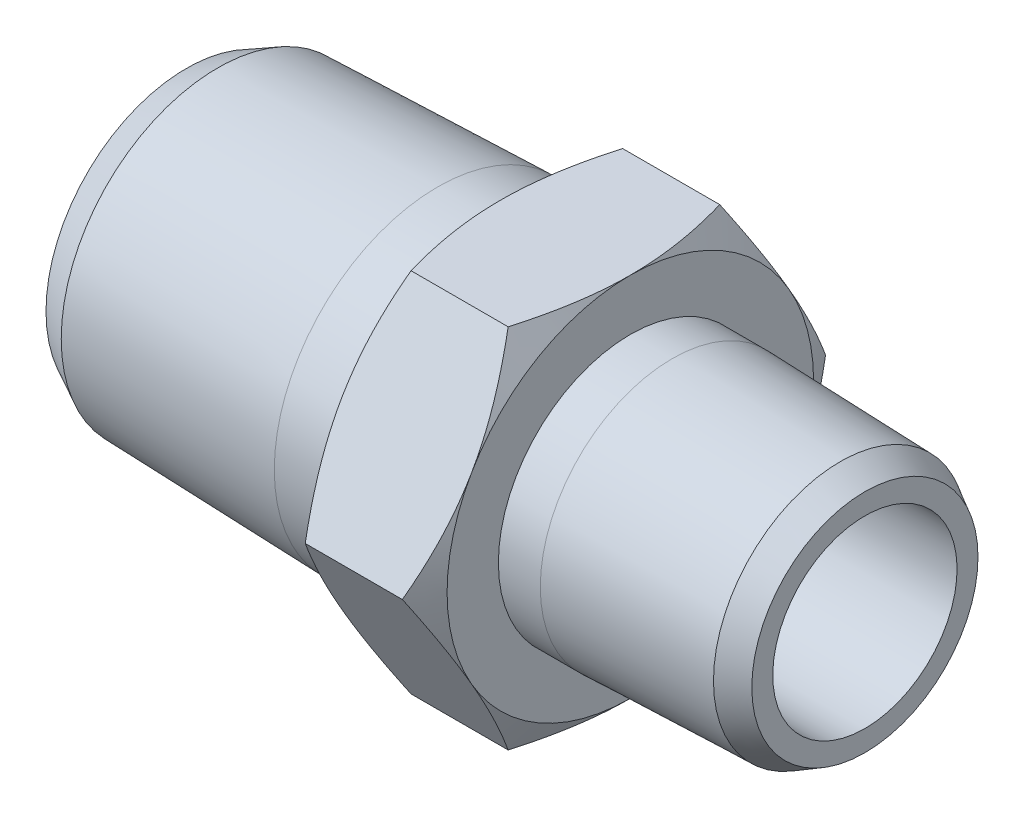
ISO-10303-21;
HEADER;
FILE_DESCRIPTION(('STEP AP214'),'2;1');
FILE_NAME('part.step','',(''),(''),'','','');
FILE_SCHEMA(('AUTOMOTIVE_DESIGN { 1 0 10303 214 1 1 1 1 }'));
ENDSEC;
DATA;
#1=APPLICATION_CONTEXT('core data for automotive mechanical design processes');
#2=APPLICATION_PROTOCOL_DEFINITION('international standard','automotive_design',2000,#1);
#3=PRODUCT_CONTEXT('',#1,'mechanical');
#4=PRODUCT('Part','Part','',(#3));
#5=PRODUCT_RELATED_PRODUCT_CATEGORY('part','',(#4));
#6=PRODUCT_DEFINITION_FORMATION('','',#4);
#7=PRODUCT_DEFINITION_CONTEXT('part definition',#1,'design');
#8=PRODUCT_DEFINITION('design','',#6,#7);
#9=PRODUCT_DEFINITION_SHAPE('','',#8);
#10=(LENGTH_UNIT() NAMED_UNIT(*) SI_UNIT(.MILLI.,.METRE.));
#11=(NAMED_UNIT(*) PLANE_ANGLE_UNIT() SI_UNIT($,.RADIAN.));
#12=(NAMED_UNIT(*) SI_UNIT($,.STERADIAN.) SOLID_ANGLE_UNIT());
#13=UNCERTAINTY_MEASURE_WITH_UNIT(LENGTH_MEASURE(1.E-05),#10,'distance_accuracy_value','');
#14=(GEOMETRIC_REPRESENTATION_CONTEXT(3) GLOBAL_UNCERTAINTY_ASSIGNED_CONTEXT((#13)) GLOBAL_UNIT_ASSIGNED_CONTEXT((#10,
#11,#12)) REPRESENTATION_CONTEXT('',''));
#15=CARTESIAN_POINT('',(0.,0.,0.));
#16=DIRECTION('',(0.,0.,1.));
#17=DIRECTION('',(1.,0.,0.));
#18=AXIS2_PLACEMENT_3D('',#15,#16,#17);
#19=CARTESIAN_POINT('',(6.87551636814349,0.,0.));
#20=DIRECTION('',(-1.,0.,0.));
#21=DIRECTION('',(0.,0.,1.));
#22=AXIS2_PLACEMENT_3D('',#19,#20,#21);
#23=CONICAL_SURFACE('',#22,12.8419243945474,1.04719755);
#24=CARTESIAN_POINT('',(7.87400000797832,0.,0.));
#25=DIRECTION('',(-1.,0.,0.));
#26=DIRECTION('',(0.,0.,1.));
#27=AXIS2_PLACEMENT_3D('',#24,#25,#26);
#28=CIRCLE('',#27,11.1125000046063);
#29=CARTESIAN_POINT('',(7.87400000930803,-5.55625000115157,-9.62370730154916));
#30=VERTEX_POINT('',#29);
#31=CARTESIAN_POINT('',(7.87400000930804,5.55625000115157,-9.62370730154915));
#32=VERTEX_POINT('',#31);
#33=EDGE_CURVE('E109',#30,#32,#28,.F.);
#34=ORIENTED_EDGE('',*,*,#33,.F.);
#35=CARTESIAN_POINT('',(6.88147153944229,2.33098820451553E-09,-12.8316097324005));
#36=CARTESIAN_POINT('',(7.03228295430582,-0.452484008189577,-12.5703679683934));
#37=CARTESIAN_POINT('',(7.17043497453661,-0.908289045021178,-12.307208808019));
#38=CARTESIAN_POINT('',(7.35330997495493,-1.59559748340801,-11.9103910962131));
#39=CARTESIAN_POINT('',(7.4100993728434,-1.82473208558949,-11.7781001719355));
#40=CARTESIAN_POINT('',(7.51490298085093,-2.28450342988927,-11.5126510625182));
#41=CARTESIAN_POINT('',(7.56291772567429,-2.51514007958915,-11.3794929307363));
#42=CARTESIAN_POINT('',(7.64940689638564,-2.97804210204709,-11.1122363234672));
#43=CARTESIAN_POINT('',(7.6878697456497,-3.2103091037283,-10.9781369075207));
#44=CARTESIAN_POINT('',(7.75444708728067,-3.67595402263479,-10.7092966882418));
#45=CARTESIAN_POINT('',(7.78256185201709,-3.9093319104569,-10.5745559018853));
#46=CARTESIAN_POINT('',(7.82795324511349,-4.37806313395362,-10.3039338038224));
#47=CARTESIAN_POINT('',(7.84517475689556,-4.6134205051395,-10.1680501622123));
#48=CARTESIAN_POINT('',(7.86822211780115,-5.08459811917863,-9.89601563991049));
#49=CARTESIAN_POINT('',(7.8740457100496,-5.32041844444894,-9.75986471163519));
#50=CARTESIAN_POINT('',(7.87400001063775,-5.55624999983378,-9.62370729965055));
#51=B_SPLINE_CURVE_WITH_KNOTS('',3,(#35,#36,#37,#38,#39,#40,#41,#42,#43,#44,#45,#46,#47,#48,#49,
#50),.UNSPECIFIED.,.F.,.F.,(4,2,2,2,2,2,2,4),(0.,1.63139647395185,2.44310868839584,
3.25477142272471,4.06741312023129,4.88003342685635,5.69673313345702,6.51359453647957),.UNSPECIFIED.);
#52=CARTESIAN_POINT('',(6.88147154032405,0.,-12.8316097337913));
#53=VERTEX_POINT('',#52);
#54=EDGE_CURVE('E122',#53,#30,#51,.T.);
#55=ORIENTED_EDGE('',*,*,#54,.F.);
#56=CARTESIAN_POINT('',(7.8740000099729,5.55624999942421,-9.62370729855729));
#57=CARTESIAN_POINT('',(7.87404570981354,5.32041844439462,-9.75986471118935));
#58=CARTESIAN_POINT('',(7.86822211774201,5.08459811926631,-9.89601563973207));
#59=CARTESIAN_POINT('',(7.84517475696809,4.61342050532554,-10.1680501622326));
#60=CARTESIAN_POINT('',(7.82795324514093,4.37806313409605,-10.3039338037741));
#61=CARTESIAN_POINT('',(7.78256185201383,3.90933191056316,-10.5745559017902));
#62=CARTESIAN_POINT('',(7.75444708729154,3.67595402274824,-10.7092966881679));
#63=CARTESIAN_POINT('',(7.68786974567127,3.2103091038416,-10.9781369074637));
#64=CARTESIAN_POINT('',(7.64940689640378,2.97804210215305,-11.1122363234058));
#65=CARTESIAN_POINT('',(7.56291772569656,2.51514007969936,-11.3794929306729));
#66=CARTESIAN_POINT('',(7.51490298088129,2.284503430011,-11.5126510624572));
#67=CARTESIAN_POINT('',(7.41009937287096,1.82473208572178,-11.7781001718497));
#68=CARTESIAN_POINT('',(7.35330997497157,1.59559748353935,-11.9103910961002));
#69=CARTESIAN_POINT('',(7.17043497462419,0.908289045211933,-12.3072088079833));
#70=CARTESIAN_POINT('',(7.03228295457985,0.452484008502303,-12.5703679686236));
#71=CARTESIAN_POINT('',(6.88147154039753,-1.60148470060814E-09,-12.831609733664));
#72=B_SPLINE_CURVE_WITH_KNOTS('',3,(#56,#57,#58,#59,#60,#61,#62,#63,#64,#65,#66,#67,#68,#69,#70,
#71),.UNSPECIFIED.,.F.,.F.,(4,2,2,2,2,2,2,4),(0.,0.816861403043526,1.63356110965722,
2.44618141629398,3.25882311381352,4.07048584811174,4.88219806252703,6.51359453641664),.UNSPECIFIED.);
#73=EDGE_CURVE('E131',#32,#53,#72,.T.);
#74=ORIENTED_EDGE('',*,*,#73,.F.);
#75=EDGE_LOOP('',(#34,#55,#74));
#76=FACE_BOUND('',#75,.T.);
#77=ADVANCED_FACE('F16',(#76),#23,.T.);
#78=CARTESIAN_POINT('',(6.87551636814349,0.,0.));
#79=DIRECTION('',(-1.,0.,0.));
#80=DIRECTION('',(0.,0.,1.));
#81=AXIS2_PLACEMENT_3D('',#78,#79,#80);
#82=CONICAL_SURFACE('',#81,12.8419243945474,1.04719755);
#83=CARTESIAN_POINT('',(7.87400000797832,0.,0.));
#84=DIRECTION('',(-1.,0.,0.));
#85=DIRECTION('',(0.,0.,1.));
#86=AXIS2_PLACEMENT_3D('',#83,#84,#85);
#87=CIRCLE('',#86,11.1125000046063);
#88=CARTESIAN_POINT('',(7.87400000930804,11.1125000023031,0.));
#89=VERTEX_POINT('',#88);
#90=EDGE_CURVE('E133',#32,#89,#87,.F.);
#91=ORIENTED_EDGE('',*,*,#90,.F.);
#92=CARTESIAN_POINT('',(6.88147153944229,11.1125000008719,-6.41580486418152));
#93=CARTESIAN_POINT('',(7.03228295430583,10.660015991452,-6.67704663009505));
#94=CARTESIAN_POINT('',(7.17043497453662,10.2042109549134,-6.94020579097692));
#95=CARTESIAN_POINT('',(7.35330997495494,9.51690251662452,-7.3370235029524));
#96=CARTESIAN_POINT('',(7.41009937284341,9.28776791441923,-7.46931442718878));
#97=CARTESIAN_POINT('',(7.51490298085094,8.82799657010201,-7.73476353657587));
#98=CARTESIAN_POINT('',(7.5629177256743,8.59735992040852,-7.86792166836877));
#99=CARTESIAN_POINT('',(7.64940689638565,8.13445789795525,-8.13517827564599));
#100=CARTESIAN_POINT('',(7.68786974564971,7.90219089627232,-8.26927769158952));
#101=CARTESIAN_POINT('',(7.75444708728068,7.43654597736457,-8.53811791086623));
#102=CARTESIAN_POINT('',(7.7825618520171,7.20316808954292,-8.67285869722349));
#103=CARTESIAN_POINT('',(7.82795324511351,6.73443686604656,-8.94348079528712));
#104=CARTESIAN_POINT('',(7.84517475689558,6.49907949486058,-9.079364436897));
#105=CARTESIAN_POINT('',(7.86822211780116,6.02790188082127,-9.35139895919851));
#106=CARTESIAN_POINT('',(7.87404571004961,5.79208155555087,-9.48754988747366));
#107=CARTESIAN_POINT('',(7.87400001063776,5.55625000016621,-9.62370729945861));
#108=B_SPLINE_CURVE_WITH_KNOTS('',3,(#92,#93,#94,#95,#96,#97,#98,#99,#100,#101,#102,#103,#104,
#105,#106,#107),.UNSPECIFIED.,.F.,.F.,(4,2,2,2,2,2,2,4),(0.,1.63139647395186,2.44310868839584,
3.25477142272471,4.0674131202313,4.88003342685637,5.69673313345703,6.51359453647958),.UNSPECIFIED.);
#109=CARTESIAN_POINT('',(6.88147154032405,11.112500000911,-6.41580486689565));
#110=VERTEX_POINT('',#109);
#111=EDGE_CURVE('E121',#110,#32,#108,.T.);
#112=ORIENTED_EDGE('',*,*,#111,.F.);
#113=CARTESIAN_POINT('',(7.8740000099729,11.1124999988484,0.));
#114=CARTESIAN_POINT('',(7.87404570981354,11.1124999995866,-0.272314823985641));
#115=CARTESIAN_POINT('',(7.868222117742,11.1124999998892,-0.544616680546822));
#116=CARTESIAN_POINT('',(7.84517475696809,11.1125000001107,-1.08868572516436));
#117=CARTESIAN_POINT('',(7.82795324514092,11.1125000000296,-1.36045300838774));
#118=CARTESIAN_POINT('',(7.78256185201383,11.1124999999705,-1.90169720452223));
#119=CARTESIAN_POINT('',(7.75444708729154,11.1124999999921,-2.17117877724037));
#120=CARTESIAN_POINT('',(7.68786974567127,11.1125000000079,-2.70885921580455));
#121=CARTESIAN_POINT('',(7.64940689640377,11.1125000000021,-2.97705804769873));
#122=CARTESIAN_POINT('',(7.56291772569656,11.1124999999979,-3.51157126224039));
#123=CARTESIAN_POINT('',(7.51490298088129,11.1124999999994,-3.77788752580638));
#124=CARTESIAN_POINT('',(7.41009937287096,11.1125000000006,-4.30878574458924));
#125=CARTESIAN_POINT('',(7.35330997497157,11.1125000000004,-4.57336759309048));
#126=CARTESIAN_POINT('',(7.17043497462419,11.1124999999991,-5.36700301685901));
#127=CARTESIAN_POINT('',(7.03228295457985,11.1124999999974,-5.89332133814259));
#128=CARTESIAN_POINT('',(6.88147154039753,11.1125,-6.41580486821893));
#129=B_SPLINE_CURVE_WITH_KNOTS('',3,(#113,#114,#115,#116,#117,#118,#119,#120,#121,#122,#123,
#124,#125,#126,#127,#128),.UNSPECIFIED.,.F.,.F.,(4,2,2,2,2,2,2,4),(0.,0.816861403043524,
1.63356110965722,2.44618141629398,3.25882311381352,4.07048584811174,4.88219806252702,
6.51359453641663),.UNSPECIFIED.);
#130=EDGE_CURVE('E424',#89,#110,#129,.T.);
#131=ORIENTED_EDGE('',*,*,#130,.F.);
#132=EDGE_LOOP('',(#91,#112,#131));
#133=FACE_BOUND('',#132,.T.);
#134=ADVANCED_FACE('F157',(#133),#82,.T.);
#135=CARTESIAN_POINT('',(6.87551636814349,0.,0.));
#136=DIRECTION('',(-1.,0.,0.));
#137=DIRECTION('',(0.,0.,1.));
#138=AXIS2_PLACEMENT_3D('',#135,#136,#137);
#139=CONICAL_SURFACE('',#138,12.8419243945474,1.04719755);
#140=CARTESIAN_POINT('',(7.8740000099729,5.55624999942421,9.62370729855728));
#141=CARTESIAN_POINT('',(7.87404570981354,5.79208155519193,9.4875498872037));
#142=CARTESIAN_POINT('',(7.86822211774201,6.02790188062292,9.35139895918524));
#143=CARTESIAN_POINT('',(7.84517475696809,6.49907949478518,9.07936443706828));
#144=CARTESIAN_POINT('',(7.82795324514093,6.73443686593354,8.94348079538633));
#145=CARTESIAN_POINT('',(7.78256185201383,7.20316808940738,8.67285869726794));
#146=CARTESIAN_POINT('',(7.75444708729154,7.43654597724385,8.53811791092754));
#147=CARTESIAN_POINT('',(7.68786974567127,7.90219089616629,8.26927769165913));
#148=CARTESIAN_POINT('',(7.64940689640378,8.13445789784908,8.13517827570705));
#149=CARTESIAN_POINT('',(7.56291772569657,8.5973599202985,7.86792166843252));
#150=CARTESIAN_POINT('',(7.5149029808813,8.82799656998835,7.73476353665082));
#151=CARTESIAN_POINT('',(7.41009937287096,9.28776791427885,7.4693144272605));
#152=CARTESIAN_POINT('',(7.35330997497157,9.51690251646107,7.33702350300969));
#153=CARTESIAN_POINT('',(7.1704349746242,10.2042109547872,6.94020579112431));
#154=CARTESIAN_POINT('',(7.03228295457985,10.6600159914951,6.67704663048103));
#155=CARTESIAN_POINT('',(6.88147154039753,11.1125000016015,6.4158048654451));
#156=B_SPLINE_CURVE_WITH_KNOTS('',3,(#140,#141,#142,#143,#144,#145,#146,#147,#148,#149,#150,
#151,#152,#153,#154,#155),.UNSPECIFIED.,.F.,.F.,(4,2,2,2,2,2,2,4),(0.,0.816861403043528,
1.63356110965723,2.44618141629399,3.25882311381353,4.07048584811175,4.88219806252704,
6.51359453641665),.UNSPECIFIED.);
#157=CARTESIAN_POINT('',(7.87400000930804,5.55625000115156,9.62370730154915));
#158=VERTEX_POINT('',#157);
#159=CARTESIAN_POINT('',(6.88147154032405,11.112500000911,6.41580486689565));
#160=VERTEX_POINT('',#159);
#161=EDGE_CURVE('E421',#158,#160,#156,.T.);
#162=ORIENTED_EDGE('',*,*,#161,.F.);
#163=CARTESIAN_POINT('',(7.87400000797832,0.,0.));
#164=DIRECTION('',(-1.,0.,0.));
#165=DIRECTION('',(0.,0.,1.));
#166=AXIS2_PLACEMENT_3D('',#163,#164,#165);
#167=CIRCLE('',#166,11.1125000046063);
#168=EDGE_CURVE('E134',#89,#158,#167,.F.);
#169=ORIENTED_EDGE('',*,*,#168,.F.);
#170=CARTESIAN_POINT('',(6.8814715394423,11.1124999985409,6.41580486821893));
#171=CARTESIAN_POINT('',(7.03228295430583,11.1124999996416,5.89332133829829));
#172=CARTESIAN_POINT('',(7.17043497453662,11.1124999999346,5.36700301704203));
#173=CARTESIAN_POINT('',(7.35330997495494,11.1125000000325,4.57336759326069));
#174=CARTESIAN_POINT('',(7.41009937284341,11.1125000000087,4.30878574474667));
#175=CARTESIAN_POINT('',(7.51490298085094,11.1124999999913,3.77788752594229));
#176=CARTESIAN_POINT('',(7.5629177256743,11.1124999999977,3.51157126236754));
#177=CARTESIAN_POINT('',(7.64940689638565,11.1125000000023,2.97705804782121));
#178=CARTESIAN_POINT('',(7.68786974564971,11.1125000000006,2.70885921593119));
#179=CARTESIAN_POINT('',(7.75444708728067,11.1124999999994,2.17117877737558));
#180=CARTESIAN_POINT('',(7.7825618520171,11.1124999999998,1.90169720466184));
#181=CARTESIAN_POINT('',(7.8279532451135,11.1125000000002,1.36045300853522));
#182=CARTESIAN_POINT('',(7.84517475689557,11.1125000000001,1.0886857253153));
#183=CARTESIAN_POINT('',(7.86822211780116,11.1124999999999,0.544616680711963));
#184=CARTESIAN_POINT('',(7.8740457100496,11.1124999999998,0.272314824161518));
#185=CARTESIAN_POINT('',(7.87400001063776,11.1125,1.91927121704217E-10));
#186=B_SPLINE_CURVE_WITH_KNOTS('',3,(#170,#171,#172,#173,#174,#175,#176,#177,#178,#179,#180,
#181,#182,#183,#184,#185),.UNSPECIFIED.,.F.,.F.,(4,2,2,2,2,2,2,4),(0.,1.63139647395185,
2.44310868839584,3.25477142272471,4.06741312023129,4.88003342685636,5.69673313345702,
6.51359453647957),.UNSPECIFIED.);
#187=EDGE_CURVE('E167',#160,#89,#186,.T.);
#188=ORIENTED_EDGE('',*,*,#187,.F.);
#189=EDGE_LOOP('',(#162,#169,#188));
#190=FACE_BOUND('',#189,.T.);
#191=ADVANCED_FACE('F636',(#190),#139,.T.);
#192=CARTESIAN_POINT('',(6.8755163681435,0.,0.));
#193=DIRECTION('',(-1.,0.,0.));
#194=DIRECTION('',(0.,0.,1.));
#195=AXIS2_PLACEMENT_3D('',#192,#193,#194);
#196=CONICAL_SURFACE('',#195,12.8419243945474,1.04719755);
#197=CARTESIAN_POINT('',(7.8740000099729,-5.55624999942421,9.62370729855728));
#198=CARTESIAN_POINT('',(7.87404570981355,-5.32041844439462,9.75986471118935));
#199=CARTESIAN_POINT('',(7.86822211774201,-5.08459811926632,9.89601563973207));
#200=CARTESIAN_POINT('',(7.8451747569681,-4.61342050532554,10.1680501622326));
#201=CARTESIAN_POINT('',(7.82795324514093,-4.37806313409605,10.3039338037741));
#202=CARTESIAN_POINT('',(7.78256185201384,-3.90933191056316,10.5745559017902));
#203=CARTESIAN_POINT('',(7.75444708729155,-3.67595402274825,10.7092966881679));
#204=CARTESIAN_POINT('',(7.68786974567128,-3.2103091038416,10.9781369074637));
#205=CARTESIAN_POINT('',(7.64940689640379,-2.97804210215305,11.1122363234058));
#206=CARTESIAN_POINT('',(7.56291772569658,-2.51514007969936,11.3794929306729));
#207=CARTESIAN_POINT('',(7.51490298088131,-2.28450343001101,11.5126510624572));
#208=CARTESIAN_POINT('',(7.41009937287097,-1.82473208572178,11.7781001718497));
#209=CARTESIAN_POINT('',(7.35330997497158,-1.59559748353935,11.9103910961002));
#210=CARTESIAN_POINT('',(7.17043497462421,-0.908289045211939,12.3072088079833));
#211=CARTESIAN_POINT('',(7.03228295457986,-0.452484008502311,12.5703679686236));
#212=CARTESIAN_POINT('',(6.88147154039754,1.60147630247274E-09,12.831609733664));
#213=B_SPLINE_CURVE_WITH_KNOTS('',3,(#197,#198,#199,#200,#201,#202,#203,#204,#205,#206,#207,
#208,#209,#210,#211,#212),.UNSPECIFIED.,.F.,.F.,(4,2,2,2,2,2,2,4),(0.,0.816861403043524,
1.63356110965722,2.44618141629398,3.25882311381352,4.07048584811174,4.88219806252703,
6.51359453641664),.UNSPECIFIED.);
#214=CARTESIAN_POINT('',(7.87400000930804,-5.55625000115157,9.62370730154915));
#215=VERTEX_POINT('',#214);
#216=CARTESIAN_POINT('',(6.88147154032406,0.,12.8316097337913));
#217=VERTEX_POINT('',#216);
#218=EDGE_CURVE('E269',#215,#217,#213,.T.);
#219=ORIENTED_EDGE('',*,*,#218,.F.);
#220=CARTESIAN_POINT('',(7.87400000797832,0.,0.));
#221=DIRECTION('',(-1.,0.,0.));
#222=DIRECTION('',(0.,0.,1.));
#223=AXIS2_PLACEMENT_3D('',#220,#221,#222);
#224=CIRCLE('',#223,11.1125000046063);
#225=EDGE_CURVE('E138',#158,#215,#224,.F.);
#226=ORIENTED_EDGE('',*,*,#225,.F.);
#227=CARTESIAN_POINT('',(6.8814715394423,-2.33099930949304E-09,12.8316097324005));
#228=CARTESIAN_POINT('',(7.03228295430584,0.452484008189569,12.5703679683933));
#229=CARTESIAN_POINT('',(7.17043497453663,0.90828904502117,12.307208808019));
#230=CARTESIAN_POINT('',(7.35330997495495,1.59559748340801,11.9103910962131));
#231=CARTESIAN_POINT('',(7.41009937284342,1.82473208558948,11.7781001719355));
#232=CARTESIAN_POINT('',(7.51490298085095,2.28450342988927,11.5126510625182));
#233=CARTESIAN_POINT('',(7.56291772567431,2.51514007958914,11.3794929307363));
#234=CARTESIAN_POINT('',(7.64940689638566,2.97804210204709,11.1122363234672));
#235=CARTESIAN_POINT('',(7.68786974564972,3.2103091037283,10.9781369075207));
#236=CARTESIAN_POINT('',(7.75444708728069,3.67595402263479,10.7092966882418));
#237=CARTESIAN_POINT('',(7.78256185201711,3.90933191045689,10.5745559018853));
#238=CARTESIAN_POINT('',(7.82795324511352,4.37806313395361,10.3039338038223));
#239=CARTESIAN_POINT('',(7.84517475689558,4.6134205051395,10.1680501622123));
#240=CARTESIAN_POINT('',(7.86822211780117,5.08459811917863,9.89601563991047));
#241=CARTESIAN_POINT('',(7.87404571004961,5.32041844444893,9.75986471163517));
#242=CARTESIAN_POINT('',(7.87400001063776,5.55624999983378,9.62370729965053));
#243=B_SPLINE_CURVE_WITH_KNOTS('',3,(#227,#228,#229,#230,#231,#232,#233,#234,#235,#236,#237,
#238,#239,#240,#241,#242),.UNSPECIFIED.,.F.,.F.,(4,2,2,2,2,2,2,4),(0.,1.63139647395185,
2.44310868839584,3.25477142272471,4.0674131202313,4.88003342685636,5.69673313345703,
6.51359453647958),.UNSPECIFIED.);
#244=EDGE_CURVE('E420',#217,#158,#243,.T.);
#245=ORIENTED_EDGE('',*,*,#244,.F.);
#246=EDGE_LOOP('',(#219,#226,#245));
#247=FACE_BOUND('',#246,.T.);
#248=ADVANCED_FACE('F258',(#247),#196,.T.);
#249=CARTESIAN_POINT('',(6.87551636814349,0.,0.));
#250=DIRECTION('',(-1.,0.,0.));
#251=DIRECTION('',(0.,0.,1.));
#252=AXIS2_PLACEMENT_3D('',#249,#250,#251);
#253=CONICAL_SURFACE('',#252,12.8419243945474,1.04719755);
#254=CARTESIAN_POINT('',(7.8740000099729,-11.1124999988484,0.));
#255=CARTESIAN_POINT('',(7.87404570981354,-11.1124999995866,0.272314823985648));
#256=CARTESIAN_POINT('',(7.868222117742,-11.1124999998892,0.544616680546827));
#257=CARTESIAN_POINT('',(7.84517475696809,-11.1125000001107,1.08868572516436));
#258=CARTESIAN_POINT('',(7.82795324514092,-11.1125000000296,1.36045300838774));
#259=CARTESIAN_POINT('',(7.78256185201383,-11.1124999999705,1.90169720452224));
#260=CARTESIAN_POINT('',(7.75444708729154,-11.1124999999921,2.17117877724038));
#261=CARTESIAN_POINT('',(7.68786974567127,-11.1125000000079,2.70885921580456));
#262=CARTESIAN_POINT('',(7.64940689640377,-11.1125000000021,2.97705804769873));
#263=CARTESIAN_POINT('',(7.56291772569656,-11.1124999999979,3.51157126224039));
#264=CARTESIAN_POINT('',(7.51490298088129,-11.1124999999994,3.77788752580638));
#265=CARTESIAN_POINT('',(7.41009937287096,-11.1125000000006,4.30878574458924));
#266=CARTESIAN_POINT('',(7.35330997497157,-11.1125000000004,4.57336759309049));
#267=CARTESIAN_POINT('',(7.1704349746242,-11.1124999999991,5.36700301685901));
#268=CARTESIAN_POINT('',(7.03228295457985,-11.1124999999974,5.89332133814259));
#269=CARTESIAN_POINT('',(6.88147154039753,-11.1125,6.41580486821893));
#270=B_SPLINE_CURVE_WITH_KNOTS('',3,(#254,#255,#256,#257,#258,#259,#260,#261,#262,#263,#264,
#265,#266,#267,#268,#269),.UNSPECIFIED.,.F.,.F.,(4,2,2,2,2,2,2,4),(0.,0.816861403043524,
1.63356110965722,2.44618141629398,3.25882311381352,4.07048584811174,4.88219806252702,
6.51359453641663),.UNSPECIFIED.);
#271=CARTESIAN_POINT('',(7.87400000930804,-11.1125000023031,0.));
#272=VERTEX_POINT('',#271);
#273=CARTESIAN_POINT('',(6.88147154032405,-11.112500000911,6.41580486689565));
#274=VERTEX_POINT('',#273);
#275=EDGE_CURVE('E242',#272,#274,#270,.T.);
#276=ORIENTED_EDGE('',*,*,#275,.F.);
#277=CARTESIAN_POINT('',(7.87400000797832,0.,0.));
#278=DIRECTION('',(-1.,0.,0.));
#279=DIRECTION('',(0.,0.,1.));
#280=AXIS2_PLACEMENT_3D('',#277,#278,#279);
#281=CIRCLE('',#280,11.1125000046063);
#282=EDGE_CURVE('E103',#215,#272,#281,.F.);
#283=ORIENTED_EDGE('',*,*,#282,.F.);
#284=CARTESIAN_POINT('',(6.88147153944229,-11.1125000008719,6.41580486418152));
#285=CARTESIAN_POINT('',(7.03228295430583,-10.660015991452,6.67704663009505));
#286=CARTESIAN_POINT('',(7.17043497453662,-10.2042109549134,6.94020579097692));
#287=CARTESIAN_POINT('',(7.35330997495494,-9.51690251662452,7.3370235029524));
#288=CARTESIAN_POINT('',(7.41009937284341,-9.28776791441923,7.46931442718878));
#289=CARTESIAN_POINT('',(7.51490298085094,-8.82799657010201,7.73476353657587));
#290=CARTESIAN_POINT('',(7.5629177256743,-8.59735992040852,7.86792166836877));
#291=CARTESIAN_POINT('',(7.64940689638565,-8.13445789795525,8.13517827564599));
#292=CARTESIAN_POINT('',(7.68786974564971,-7.90219089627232,8.26927769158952));
#293=CARTESIAN_POINT('',(7.75444708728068,-7.43654597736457,8.53811791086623));
#294=CARTESIAN_POINT('',(7.7825618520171,-7.20316808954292,8.67285869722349));
#295=CARTESIAN_POINT('',(7.82795324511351,-6.73443686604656,8.94348079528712));
#296=CARTESIAN_POINT('',(7.84517475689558,-6.49907949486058,9.079364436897));
#297=CARTESIAN_POINT('',(7.86822211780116,-6.02790188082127,9.35139895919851));
#298=CARTESIAN_POINT('',(7.87404571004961,-5.79208155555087,9.48754988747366));
#299=CARTESIAN_POINT('',(7.87400001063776,-5.55625000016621,9.62370729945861));
#300=B_SPLINE_CURVE_WITH_KNOTS('',3,(#284,#285,#286,#287,#288,#289,#290,#291,#292,#293,#294,
#295,#296,#297,#298,#299),.UNSPECIFIED.,.F.,.F.,(4,2,2,2,2,2,2,4),(0.,1.63139647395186,
2.44310868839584,3.25477142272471,4.0674131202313,4.88003342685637,5.69673313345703,
6.51359453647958),.UNSPECIFIED.);
#301=EDGE_CURVE('E262',#274,#215,#300,.T.);
#302=ORIENTED_EDGE('',*,*,#301,.F.);
#303=EDGE_LOOP('',(#276,#283,#302));
#304=FACE_BOUND('',#303,.T.);
#305=ADVANCED_FACE('F253',(#304),#253,.T.);
#306=CARTESIAN_POINT('',(6.87551636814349,0.,0.));
#307=DIRECTION('',(-1.,0.,0.));
#308=DIRECTION('',(0.,0.,1.));
#309=AXIS2_PLACEMENT_3D('',#306,#307,#308);
#310=CONICAL_SURFACE('',#309,12.8419243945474,1.04719755);
#311=CARTESIAN_POINT('',(7.87400000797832,0.,0.));
#312=DIRECTION('',(-1.,0.,0.));
#313=DIRECTION('',(0.,0.,1.));
#314=AXIS2_PLACEMENT_3D('',#311,#312,#313);
#315=CIRCLE('',#314,11.1125000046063);
#316=EDGE_CURVE('E20',#272,#30,#315,.F.);
#317=ORIENTED_EDGE('',*,*,#316,.F.);
#318=CARTESIAN_POINT('',(6.88147153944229,-11.1124999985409,-6.41580486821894));
#319=CARTESIAN_POINT('',(7.03228295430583,-11.1124999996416,-5.8933213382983));
#320=CARTESIAN_POINT('',(7.17043497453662,-11.1124999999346,-5.36700301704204));
#321=CARTESIAN_POINT('',(7.35330997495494,-11.1125000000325,-4.57336759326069));
#322=CARTESIAN_POINT('',(7.41009937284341,-11.1125000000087,-4.30878574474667));
#323=CARTESIAN_POINT('',(7.51490298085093,-11.1124999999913,-3.77788752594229));
#324=CARTESIAN_POINT('',(7.56291772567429,-11.1124999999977,-3.51157126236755));
#325=CARTESIAN_POINT('',(7.64940689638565,-11.1125000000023,-2.97705804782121));
#326=CARTESIAN_POINT('',(7.68786974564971,-11.1125000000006,-2.70885921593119));
#327=CARTESIAN_POINT('',(7.75444708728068,-11.1124999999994,-2.17117877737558));
#328=CARTESIAN_POINT('',(7.7825618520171,-11.1124999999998,-1.90169720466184));
#329=CARTESIAN_POINT('',(7.8279532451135,-11.1125000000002,-1.36045300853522));
#330=CARTESIAN_POINT('',(7.84517475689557,-11.1125000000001,-1.0886857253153));
#331=CARTESIAN_POINT('',(7.86822211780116,-11.1124999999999,-0.54461668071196));
#332=CARTESIAN_POINT('',(7.8740457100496,-11.1124999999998,-0.272314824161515));
#333=CARTESIAN_POINT('',(7.87400001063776,-11.1125,-1.91921646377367E-10));
#334=B_SPLINE_CURVE_WITH_KNOTS('',3,(#318,#319,#320,#321,#322,#323,#324,#325,#326,#327,#328,
#329,#330,#331,#332,#333),.UNSPECIFIED.,.F.,.F.,(4,2,2,2,2,2,2,4),(0.,1.63139647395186,
2.44310868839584,3.25477142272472,4.0674131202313,4.88003342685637,5.69673313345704,
6.51359453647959),.UNSPECIFIED.);
#335=CARTESIAN_POINT('',(6.88147154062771,-11.112500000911,-6.41580486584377));
#336=VERTEX_POINT('',#335);
#337=EDGE_CURVE('E117',#336,#272,#334,.T.);
#338=ORIENTED_EDGE('',*,*,#337,.F.);
#339=CARTESIAN_POINT('',(7.87400000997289,-5.55624999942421,-9.62370729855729));
#340=CARTESIAN_POINT('',(7.87404570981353,-5.79208155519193,-9.48754988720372));
#341=CARTESIAN_POINT('',(7.868222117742,-6.02790188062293,-9.35139895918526));
#342=CARTESIAN_POINT('',(7.84517475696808,-6.49907949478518,-9.0793644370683));
#343=CARTESIAN_POINT('',(7.82795324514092,-6.73443686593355,-8.94348079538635));
#344=CARTESIAN_POINT('',(7.78256185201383,-7.20316808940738,-8.67285869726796));
#345=CARTESIAN_POINT('',(7.75444708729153,-7.43654597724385,-8.53811791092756));
#346=CARTESIAN_POINT('',(7.68786974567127,-7.90219089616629,-8.26927769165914));
#347=CARTESIAN_POINT('',(7.64940689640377,-8.13445789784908,-8.13517827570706));
#348=CARTESIAN_POINT('',(7.56291772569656,-8.5973599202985,-7.86792166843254));
#349=CARTESIAN_POINT('',(7.51490298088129,-8.82799656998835,-7.73476353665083));
#350=CARTESIAN_POINT('',(7.41009937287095,-9.28776791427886,-7.46931442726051));
#351=CARTESIAN_POINT('',(7.35330997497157,-9.51690251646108,-7.3370235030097));
#352=CARTESIAN_POINT('',(7.17043497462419,-10.2042109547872,-6.94020579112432));
#353=CARTESIAN_POINT('',(7.03228295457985,-10.6600159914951,-6.67704663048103));
#354=CARTESIAN_POINT('',(6.88147154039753,-11.1125000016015,-6.4158048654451));
#355=B_SPLINE_CURVE_WITH_KNOTS('',3,(#339,#340,#341,#342,#343,#344,#345,#346,#347,#348,#349,
#350,#351,#352,#353,#354),.UNSPECIFIED.,.F.,.F.,(4,2,2,2,2,2,2,4),(0.,0.816861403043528,
1.63356110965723,2.44618141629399,3.25882311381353,4.07048584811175,4.88219806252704,
6.51359453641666),.UNSPECIFIED.);
#356=EDGE_CURVE('E113',#30,#336,#355,.T.);
#357=ORIENTED_EDGE('',*,*,#356,.F.);
#358=EDGE_LOOP('',(#317,#338,#357));
#359=FACE_BOUND('',#358,.T.);
#360=ADVANCED_FACE('F115',(#359),#310,.T.);
#361=CARTESIAN_POINT('',(7.874,0.,0.));
#362=DIRECTION('',(1.,0.,0.));
#363=DIRECTION('',(0.,0.,-1.));
#364=AXIS2_PLACEMENT_3D('',#361,#362,#363);
#365=PLANE('',#364);
#366=CARTESIAN_POINT('',(7.874,0.,0.));
#367=DIRECTION('',(1.,0.,0.));
#368=DIRECTION('',(0.,1.,0.));
#369=AXIS2_PLACEMENT_3D('',#366,#367,#368);
#370=CIRCLE('',#369,8.001);
#371=CARTESIAN_POINT('',(7.874,8.001,0.));
#372=VERTEX_POINT('',#371);
#373=EDGE_CURVE('E234',#372,#372,#370,.T.);
#374=ORIENTED_EDGE('',*,*,#373,.F.);
#375=EDGE_LOOP('',(#374));
#376=FACE_BOUND('',#375,.T.);
#377=ORIENTED_EDGE('',*,*,#225,.T.);
#378=ORIENTED_EDGE('',*,*,#282,.T.);
#379=ORIENTED_EDGE('',*,*,#316,.T.);
#380=ORIENTED_EDGE('',*,*,#33,.T.);
#381=ORIENTED_EDGE('',*,*,#90,.T.);
#382=ORIENTED_EDGE('',*,*,#168,.T.);
#383=EDGE_LOOP('',(#377,#378,#379,#380,#381,#382));
#384=FACE_BOUND('',#383,.T.);
#385=ADVANCED_FACE('F107',(#376,#384),#365,.T.);
#386=CARTESIAN_POINT('',(0.,0.,-12.8316097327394));
#387=DIRECTION('',(0.,-0.5,-0.866025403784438));
#388=DIRECTION('',(0.,0.866025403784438,-0.5));
#389=AXIS2_PLACEMENT_3D('',#386,#387,#388);
#390=PLANE('',#389);
#391=CARTESIAN_POINT('',(0.99252845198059,-2.12642086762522E-08,-12.8316097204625));
#392=CARTESIAN_POINT('',(0.84171703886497,-0.452484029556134,-12.5703679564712));
#393=CARTESIAN_POINT('',(0.703565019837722,-0.908289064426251,-12.307208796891));
#394=CARTESIAN_POINT('',(0.520690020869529,-1.59559749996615,-11.9103910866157));
#395=CARTESIAN_POINT('',(0.463900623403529,-1.82473210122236,-11.7781001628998));
#396=CARTESIAN_POINT('',(0.359097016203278,-2.28450344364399,-11.512651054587));
#397=CARTESIAN_POINT('',(0.311082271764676,-2.51514009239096,-11.3794929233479));
#398=CARTESIAN_POINT('',(0.224593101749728,-2.97804211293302,-11.1122363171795));
#399=CARTESIAN_POINT('',(0.186130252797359,-3.21030911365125,-10.978136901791));
#400=CARTESIAN_POINT('',(0.119552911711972,-3.67595403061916,-10.7092966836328));
#401=CARTESIAN_POINT('',(0.0914381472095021,-3.90933191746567,-10.574555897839));
#402=CARTESIAN_POINT('',(0.0460467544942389,-4.37806313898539,-10.303933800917));
#403=CARTESIAN_POINT('',(0.0288252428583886,-4.61342050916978,-10.1680501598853));
#404=CARTESIAN_POINT('',(0.00577788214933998,-5.08459812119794,-9.89601563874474));
#405=CARTESIAN_POINT('',(-4.57100489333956E-05,-5.32041844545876,-9.75986471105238));
#406=CARTESIAN_POINT('',(-1.06377378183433E-08,-5.55624999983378,-9.62370729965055));
#407=B_SPLINE_CURVE_WITH_KNOTS('',3,(#391,#392,#393,#394,#395,#396,#397,#398,#399,#400,#401,
#402,#403,#404,#405,#406),.UNSPECIFIED.,.F.,.F.,(4,2,2,2,2,2,2,4),(0.,1.63139646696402,
2.44310867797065,3.2547714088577,4.06741310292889,4.8800334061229,5.69673310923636,
6.51359450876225),.UNSPECIFIED.);
#408=CARTESIAN_POINT('',(0.99252845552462,1.06320893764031E-08,-12.831609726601));
#409=VERTEX_POINT('',#408);
#410=CARTESIAN_POINT('',(-9.30802141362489E-09,-5.55625000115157,-9.62370730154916));
#411=VERTEX_POINT('',#410);
#412=EDGE_CURVE('E203',#409,#411,#407,.T.);
#413=ORIENTED_EDGE('',*,*,#412,.F.);
#414=DIRECTION('',(1.,0.,0.));
#415=VECTOR('',#414,1.);
#416=CARTESIAN_POINT('',(0.,0.,-12.8316097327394));
#417=LINE('',#416,#415);
#418=EDGE_CURVE('E128',#53,#409,#417,.F.);
#419=ORIENTED_EDGE('',*,*,#418,.F.);
#420=ORIENTED_EDGE('',*,*,#54,.T.);
#421=ORIENTED_EDGE('',*,*,#356,.T.);
#422=DIRECTION('',(1.,0.,0.));
#423=VECTOR('',#422,1.);
#424=CARTESIAN_POINT('',(0.,-11.1125,-6.41580486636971));
#425=LINE('',#424,#423);
#426=CARTESIAN_POINT('',(0.992528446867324,-11.112499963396,-6.41580488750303));
#427=VERTEX_POINT('',#426);
#428=EDGE_CURVE('E241',#427,#336,#425,.T.);
#429=ORIENTED_EDGE('',*,*,#428,.F.);
#430=CARTESIAN_POINT('',(-9.97287768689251E-09,-5.55624999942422,-9.62370729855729));
#431=CARTESIAN_POINT('',(-4.57098110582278E-05,-5.79208155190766,-9.4875498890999));
#432=CARTESIAN_POINT('',(0.00577788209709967,-6.02790187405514,-9.35139896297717));
#433=CARTESIAN_POINT('',(0.0288252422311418,-6.49907948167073,-9.07936444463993));
#434=CARTESIAN_POINT('',(0.04604675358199,-6.73443684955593,-8.94348080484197));
#435=CARTESIAN_POINT('',(0.091438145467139,-7.20316806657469,-8.67285871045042));
#436=CARTESIAN_POINT('',(0.119552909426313,-7.43654595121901,-8.538117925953));
#437=CARTESIAN_POINT('',(0.186130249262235,-7.90219086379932,-8.26927771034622));
#438=CARTESIAN_POINT('',(0.22459309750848,-8.13445786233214,-8.13517829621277));
#439=CARTESIAN_POINT('',(0.311082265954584,-8.597359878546,-7.86792169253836));
#440=CARTESIAN_POINT('',(0.359097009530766,-8.82799652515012,-7.7347635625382));
#441=CARTESIAN_POINT('',(0.463900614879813,-9.28776786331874,-7.46931445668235));
#442=CARTESIAN_POINT('',(0.520690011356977,-9.5169024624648,-7.33702353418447));
#443=CARTESIAN_POINT('',(0.703565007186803,-10.2042108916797,-6.94020582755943));
#444=CARTESIAN_POINT('',(0.841717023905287,-10.6600159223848,-6.67704667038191));
#445=CARTESIAN_POINT('',(0.99252843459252,-11.1124999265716,-6.41580490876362));
#446=B_SPLINE_CURVE_WITH_KNOTS('',3,(#430,#431,#432,#433,#434,#435,#436,#437,#438,#439,#440,
#441,#442,#443,#444,#445),.UNSPECIFIED.,.F.,.F.,(4,2,2,2,2,2,2,4),(0.,0.816861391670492,
1.63356108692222,2.44618138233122,3.25882306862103,4.07048579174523,4.8821979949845,
6.51359444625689),.UNSPECIFIED.);
#447=EDGE_CURVE('E229',#411,#427,#446,.T.);
#448=ORIENTED_EDGE('',*,*,#447,.F.);
#449=EDGE_LOOP('',(#413,#419,#420,#421,#429,#448));
#450=FACE_BOUND('',#449,.T.);
#451=ADVANCED_FACE('F127',(#450),#390,.T.);
#452=CARTESIAN_POINT('',(0.,11.1125,-6.41580486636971));
#453=DIRECTION('',(0.,0.5,-0.866025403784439));
#454=DIRECTION('',(0.,0.866025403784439,0.5));
#455=AXIS2_PLACEMENT_3D('',#452,#453,#454);
#456=PLANE('',#455);
#457=CARTESIAN_POINT('',(0.992528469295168,11.1125000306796,-6.41580484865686));
#458=CARTESIAN_POINT('',(0.841717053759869,10.6600160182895,-6.67704661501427));
#459=CARTESIAN_POINT('',(0.703565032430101,10.2042109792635,-6.94020577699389));
#460=CARTESIAN_POINT('',(0.520690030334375,9.51690253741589,-7.33702349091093));
#461=CARTESIAN_POINT('',(0.463900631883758,9.28776793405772,-7.46931441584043));
#462=CARTESIAN_POINT('',(0.359097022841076,8.82799658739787,-7.73476352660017));
#463=CARTESIAN_POINT('',(0.311082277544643,8.59735993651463,-7.8679216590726));
#464=CARTESIAN_POINT('',(0.224593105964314,8.13445791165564,-8.13517826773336));
#465=CARTESIAN_POINT('',(0.186130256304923,7.90219090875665,-8.26927768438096));
#466=CARTESIAN_POINT('',(0.119552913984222,7.43654598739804,-8.53811790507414));
#467=CARTESIAN_POINT('',(0.0914381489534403,7.20316809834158,-8.67285869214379));
#468=CARTESIAN_POINT('',(0.0460467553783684,6.73443687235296,-8.9434807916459));
#469=CARTESIAN_POINT('',(0.0288252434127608,6.49907949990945,-9.07936443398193));
#470=CARTESIAN_POINT('',(0.00577788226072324,6.02790188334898,-9.35139895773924));
#471=CARTESIAN_POINT('',(-4.57100506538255E-05,5.79208155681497,-9.48754988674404));
#472=CARTESIAN_POINT('',(-1.06377432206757E-08,5.55625000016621,-9.62370729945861));
#473=B_SPLINE_CURVE_WITH_KNOTS('',3,(#457,#458,#459,#460,#461,#462,#463,#464,#465,#466,#467,
#468,#469,#470,#471,#472),.UNSPECIFIED.,.F.,.F.,(4,2,2,2,2,2,2,4),(0.,1.6313964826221,
2.44310870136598,3.25477143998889,4.06741314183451,4.88003345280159,5.69673316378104,
6.51359457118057),.UNSPECIFIED.);
#474=CARTESIAN_POINT('',(0.992528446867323,11.1125,-6.41580482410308));
#475=VERTEX_POINT('',#474);
#476=CARTESIAN_POINT('',(-9.30802446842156E-09,5.55625000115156,-9.62370730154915));
#477=VERTEX_POINT('',#476);
#478=EDGE_CURVE('E187',#475,#477,#473,.T.);
#479=ORIENTED_EDGE('',*,*,#478,.F.);
#480=DIRECTION('',(1.,0.,0.));
#481=VECTOR('',#480,1.);
#482=CARTESIAN_POINT('',(0.,11.1125,-6.41580486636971));
#483=LINE('',#482,#481);
#484=EDGE_CURVE('E422',#110,#475,#483,.F.);
#485=ORIENTED_EDGE('',*,*,#484,.F.);
#486=ORIENTED_EDGE('',*,*,#111,.T.);
#487=ORIENTED_EDGE('',*,*,#73,.T.);
#488=ORIENTED_EDGE('',*,*,#418,.T.);
#489=CARTESIAN_POINT('',(-9.97288451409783E-09,5.55624999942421,-9.62370729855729));
#490=CARTESIAN_POINT('',(-4.57098127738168E-05,5.32041844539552,-9.75986471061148));
#491=CARTESIAN_POINT('',(0.0057778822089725,5.08459812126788,-9.89601563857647));
#492=CARTESIAN_POINT('',(0.0288252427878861,4.61342050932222,-10.1680501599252));
#493=CARTESIAN_POINT('',(0.0460467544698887,4.3780631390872,-10.3039338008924));
#494=CARTESIAN_POINT('',(0.0914381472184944,3.90933191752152,-10.5745558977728));
#495=CARTESIAN_POINT('',(0.119552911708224,3.67595403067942,-10.7092966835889));
#496=CARTESIAN_POINT('',(0.186130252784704,3.21030911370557,-10.9781369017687));
#497=CARTESIAN_POINT('',(0.224593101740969,2.97804211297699,-11.1122363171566));
#498=CARTESIAN_POINT('',(0.311082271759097,2.51514009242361,-11.3794929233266));
#499=CARTESIAN_POINT('',(0.35909701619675,2.28450344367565,-11.5126510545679));
#500=CARTESIAN_POINT('',(0.463900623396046,1.82473210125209,-11.7781001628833));
#501=CARTESIAN_POINT('',(0.520690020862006,1.59559749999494,-11.9103910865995));
#502=CARTESIAN_POINT('',(0.703565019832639,0.908289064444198,-12.3072087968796));
#503=CARTESIAN_POINT('',(0.841717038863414,0.45248402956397,-12.5703679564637));
#504=CARTESIAN_POINT('',(0.992528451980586,2.12641908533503E-08,-12.8316097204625));
#505=B_SPLINE_CURVE_WITH_KNOTS('',3,(#489,#490,#491,#492,#493,#494,#495,#496,#497,#498,#499,
#500,#501,#502,#503,#504),.UNSPECIFIED.,.F.,.F.,(4,2,2,2,2,2,2,4),(0.,0.816861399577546,
1.63356110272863,2.44618140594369,3.25882310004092,4.07048583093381,4.88219804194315,
6.51359450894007),.UNSPECIFIED.);
#506=EDGE_CURVE('E195',#477,#409,#505,.T.);
#507=ORIENTED_EDGE('',*,*,#506,.F.);
#508=EDGE_LOOP('',(#479,#485,#486,#487,#488,#507));
#509=FACE_BOUND('',#508,.T.);
#510=ADVANCED_FACE('F176',(#509),#456,.T.);
#511=CARTESIAN_POINT('',(0.,11.1125,6.41580486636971));
#512=DIRECTION('',(0.,1.,0.));
#513=DIRECTION('',(0.,0.,1.));
#514=AXIS2_PLACEMENT_3D('',#511,#512,#513);
#515=PLANE('',#514);
#516=CARTESIAN_POINT('',(0.99252843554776,11.1124999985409,6.41580478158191));
#517=CARTESIAN_POINT('',(0.841717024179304,11.1124999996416,5.89332125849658));
#518=CARTESIAN_POINT('',(0.703565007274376,11.1124999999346,5.36700294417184));
#519=CARTESIAN_POINT('',(0.520690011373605,11.1125000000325,4.57336753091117));
#520=CARTESIAN_POINT('',(0.463900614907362,11.1125000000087,4.30878568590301));
#521=CARTESIAN_POINT('',(0.359097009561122,11.1124999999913,3.77788747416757));
#522=CARTESIAN_POINT('',(0.31108226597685,11.1124999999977,3.51157121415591));
#523=CARTESIAN_POINT('',(0.2245930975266,11.1125000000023,2.97705800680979));
#524=CARTESIAN_POINT('',(0.186130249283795,11.1125000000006,2.70885917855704));
#525=CARTESIAN_POINT('',(0.11955290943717,11.1124999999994,2.17117874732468));
#526=CARTESIAN_POINT('',(0.0914381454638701,11.1124999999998,1.90169717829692));
#527=CARTESIAN_POINT('',(0.0460467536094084,11.1125000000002,1.36045298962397));
#528=CARTESIAN_POINT('',(0.0288252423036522,11.1125000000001,1.08868571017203));
#529=CARTESIAN_POINT('',(0.00577788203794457,11.1124999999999,0.544616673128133));
#530=CARTESIAN_POINT('',(-4.57100471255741E-05,11.1124999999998,0.27231482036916));
#531=CARTESIAN_POINT('',(-1.06377410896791E-08,11.1125,1.91928517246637E-10));
#532=B_SPLINE_CURVE_WITH_KNOTS('',3,(#516,#517,#518,#519,#520,#521,#522,#523,#524,#525,#526,
#527,#528,#529,#530,#531),.UNSPECIFIED.,.F.,.F.,(4,2,2,2,2,2,2,4),(0.,1.63139645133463,
2.4431086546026,3.25477137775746,4.06741306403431,4.88003335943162,5.69673305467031,
6.51359444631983),.UNSPECIFIED.);
#533=CARTESIAN_POINT('',(0.992528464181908,11.1125000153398,6.41580485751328));
#534=VERTEX_POINT('',#533);
#535=CARTESIAN_POINT('',(-9.3080235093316E-09,11.1125000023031,0.));
#536=VERTEX_POINT('',#535);
#537=EDGE_CURVE('E319',#534,#536,#532,.T.);
#538=ORIENTED_EDGE('',*,*,#537,.F.);
#539=DIRECTION('',(1.,0.,0.));
#540=VECTOR('',#539,1.);
#541=CARTESIAN_POINT('',(0.,11.1125,6.41580486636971));
#542=LINE('',#541,#540);
#543=EDGE_CURVE('E418',#160,#534,#542,.F.);
#544=ORIENTED_EDGE('',*,*,#543,.F.);
#545=ORIENTED_EDGE('',*,*,#187,.T.);
#546=ORIENTED_EDGE('',*,*,#130,.T.);
#547=ORIENTED_EDGE('',*,*,#484,.T.);
#548=CARTESIAN_POINT('',(-9.97288332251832E-09,11.1124999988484,0.));
#549=CARTESIAN_POINT('',(-4.57098110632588E-05,11.1124999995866,-0.272314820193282));
#550=CARTESIAN_POINT('',(0.00577788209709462,11.1124999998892,-0.54461667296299));
#551=CARTESIAN_POINT('',(0.0288252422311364,11.1125000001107,-1.08868571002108));
#552=CARTESIAN_POINT('',(0.0460467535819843,11.1125000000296,-1.36045298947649));
#553=CARTESIAN_POINT('',(0.0914381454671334,11.1124999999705,-1.90169717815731));
#554=CARTESIAN_POINT('',(0.119552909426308,11.1124999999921,-2.17117874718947));
#555=CARTESIAN_POINT('',(0.18613024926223,11.1125000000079,-2.7088591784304));
#556=CARTESIAN_POINT('',(0.224593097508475,11.1125000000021,-2.9770580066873));
#557=CARTESIAN_POINT('',(0.311082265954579,11.1124999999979,-3.51157121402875));
#558=CARTESIAN_POINT('',(0.359097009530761,11.1124999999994,-3.77788747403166));
#559=CARTESIAN_POINT('',(0.463900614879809,11.1125000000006,-4.30878568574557));
#560=CARTESIAN_POINT('',(0.520690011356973,11.1125000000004,-4.57336753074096));
#561=CARTESIAN_POINT('',(0.703565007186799,11.1124999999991,-5.3670029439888));
#562=CARTESIAN_POINT('',(0.841717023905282,11.1124999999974,-5.89332125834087));
#563=CARTESIAN_POINT('',(0.992528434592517,11.1125,-6.4158047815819));
#564=B_SPLINE_CURVE_WITH_KNOTS('',3,(#548,#549,#550,#551,#552,#553,#554,#555,#556,#557,#558,
#559,#560,#561,#562,#563),.UNSPECIFIED.,.F.,.F.,(4,2,2,2,2,2,2,4),(0.,0.816861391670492,
1.63356108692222,2.44618138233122,3.25882306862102,4.07048579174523,4.8821979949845,
6.51359444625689),.UNSPECIFIED.);
#565=EDGE_CURVE('E327',#536,#475,#564,.T.);
#566=ORIENTED_EDGE('',*,*,#565,.F.);
#567=EDGE_LOOP('',(#538,#544,#545,#546,#547,#566));
#568=FACE_BOUND('',#567,.T.);
#569=ADVANCED_FACE('F179',(#568),#515,.T.);
#570=CARTESIAN_POINT('',(0.,0.,12.8316097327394));
#571=DIRECTION('',(0.,0.5,0.866025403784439));
#572=DIRECTION('',(0.,-0.866025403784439,0.5));
#573=AXIS2_PLACEMENT_3D('',#570,#571,#572);
#574=PLANE('',#573);
#575=DIRECTION('',(1.,0.,0.));
#576=VECTOR('',#575,1.);
#577=CARTESIAN_POINT('',(0.,0.,12.8316097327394));
#578=LINE('',#577,#576);
#579=CARTESIAN_POINT('',(0.992528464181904,1.53397786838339E-08,12.8316097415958));
#580=VERTEX_POINT('',#579);
#581=EDGE_CURVE('E268',#217,#580,#578,.F.);
#582=ORIENTED_EDGE('',*,*,#581,.F.);
#583=ORIENTED_EDGE('',*,*,#244,.T.);
#584=ORIENTED_EDGE('',*,*,#161,.T.);
#585=ORIENTED_EDGE('',*,*,#543,.T.);
#586=CARTESIAN_POINT('',(-9.97288954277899E-09,5.55624999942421,9.62370729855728));
#587=CARTESIAN_POINT('',(-4.57098144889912E-05,5.79208155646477,9.48754988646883));
#588=CARTESIAN_POINT('',(0.00577788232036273,6.02790188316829,9.35139895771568));
#589=CARTESIAN_POINT('',(0.0288252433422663,6.49907949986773,9.07936443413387));
#590=CARTESIAN_POINT('',(0.0460467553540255,6.73443687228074,8.94348079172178));
#591=CARTESIAN_POINT('',(0.09143814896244,7.20316809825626,8.67285869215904));
#592=CARTESIAN_POINT('',(0.119552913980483,7.43654598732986,8.53811790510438));
#593=CARTESIAN_POINT('',(0.186130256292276,7.90219090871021,8.26927768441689));
#594=CARTESIAN_POINT('',(0.224593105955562,8.13445791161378,8.13517826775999));
#595=CARTESIAN_POINT('',(0.31108227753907,8.59735993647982,7.86792165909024));
#596=CARTESIAN_POINT('',(0.359097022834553,8.82799658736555,7.73476352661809));
#597=CARTESIAN_POINT('',(0.463900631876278,9.2877679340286,7.46931441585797));
#598=CARTESIAN_POINT('',(0.520690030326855,9.5169025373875,7.33702349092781));
#599=CARTESIAN_POINT('',(0.703565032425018,10.2042109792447,6.94020577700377));
#600=CARTESIAN_POINT('',(0.841717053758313,10.660016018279,6.67704661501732));
#601=CARTESIAN_POINT('',(0.992528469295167,11.1125000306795,6.41580484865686));
#602=B_SPLINE_CURVE_WITH_KNOTS('',3,(#586,#587,#588,#589,#590,#591,#592,#593,#594,#595,#596,
#597,#598,#599,#600,#601),.UNSPECIFIED.,.F.,.F.,(4,2,2,2,2,2,2,4),(0.,0.81686140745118,
1.63356111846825,2.44618142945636,3.25882313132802,4.07048586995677,4.88219808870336,
6.51359457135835),.UNSPECIFIED.);
#603=CARTESIAN_POINT('',(-9.30802526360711E-09,5.55625000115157,9.62370730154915));
#604=VERTEX_POINT('',#603);
#605=EDGE_CURVE('E315',#604,#534,#602,.T.);
#606=ORIENTED_EDGE('',*,*,#605,.F.);
#607=CARTESIAN_POINT('',(0.992528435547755,7.26988623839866E-08,12.8316096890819));
#608=CARTESIAN_POINT('',(0.841717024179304,0.452484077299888,12.5703679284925));
#609=CARTESIAN_POINT('',(0.703565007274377,0.908289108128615,12.3072087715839));
#610=CARTESIAN_POINT('',(0.520690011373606,1.59559753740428,11.9103910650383));
#611=CARTESIAN_POINT('',(0.463900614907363,1.82473213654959,11.7781001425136));
#612=CARTESIAN_POINT('',(0.359097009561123,2.28450347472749,11.5126510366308));
#613=CARTESIAN_POINT('',(0.311082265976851,2.51514012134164,11.3794929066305));
#614=CARTESIAN_POINT('',(0.224593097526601,2.97804213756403,11.1122363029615));
#615=CARTESIAN_POINT('',(0.186130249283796,3.21030913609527,10.9781368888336));
#616=CARTESIAN_POINT('',(0.119552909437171,3.67595404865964,10.7092966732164));
#617=CARTESIAN_POINT('',(0.0914381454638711,3.90933193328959,10.5745558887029));
#618=CARTESIAN_POINT('',(0.0460467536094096,4.37806315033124,10.3039337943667));
#619=CARTESIAN_POINT('',(0.0288252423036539,4.61342051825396,10.1680501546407));
#620=CARTESIAN_POINT('',(0.00577788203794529,5.08459812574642,9.89601563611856));
#621=CARTESIAN_POINT('',(-4.57100471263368E-05,5.32041844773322,9.75986470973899));
#622=CARTESIAN_POINT('',(-1.0637745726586E-08,5.55624999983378,9.62370729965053));
#623=B_SPLINE_CURVE_WITH_KNOTS('',3,(#607,#608,#609,#610,#611,#612,#613,#614,#615,#616,#617,
#618,#619,#620,#621,#622),.UNSPECIFIED.,.F.,.F.,(4,2,2,2,2,2,2,4),(0.,1.63139645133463,
2.4431086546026,3.25477137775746,4.06741306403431,4.88003335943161,5.69673305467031,
6.51359444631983),.UNSPECIFIED.);
#624=EDGE_CURVE('E297',#580,#604,#623,.T.);
#625=ORIENTED_EDGE('',*,*,#624,.F.);
#626=EDGE_LOOP('',(#582,#583,#584,#585,#606,#625));
#627=FACE_BOUND('',#626,.T.);
#628=ADVANCED_FACE('F277',(#627),#574,.T.);
#629=CARTESIAN_POINT('',(0.,-11.1125,6.41580486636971));
#630=DIRECTION('',(0.,-0.5,0.866025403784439));
#631=DIRECTION('',(0.,-0.866025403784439,-0.5));
#632=AXIS2_PLACEMENT_3D('',#629,#630,#631);
#633=PLANE('',#632);
#634=DIRECTION('',(1.,0.,0.));
#635=VECTOR('',#634,1.);
#636=CARTESIAN_POINT('',(0.,-11.1125,6.41580486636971));
#637=LINE('',#636,#635);
#638=CARTESIAN_POINT('',(0.992528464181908,-11.1125,6.41580488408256));
#639=VERTEX_POINT('',#638);
#640=EDGE_CURVE('E366',#274,#639,#637,.F.);
#641=ORIENTED_EDGE('',*,*,#640,.F.);
#642=ORIENTED_EDGE('',*,*,#301,.T.);
#643=ORIENTED_EDGE('',*,*,#218,.T.);
#644=ORIENTED_EDGE('',*,*,#581,.T.);
#645=CARTESIAN_POINT('',(-9.97288754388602E-09,-5.55624999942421,9.62370729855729));
#646=CARTESIAN_POINT('',(-4.57098144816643E-05,-5.32041844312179,9.75986471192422));
#647=CARTESIAN_POINT('',(0.0057778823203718,-5.08459811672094,9.89601564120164));
#648=CARTESIAN_POINT('',(0.0288252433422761,-4.61342050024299,10.1680501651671));
#649=CARTESIAN_POINT('',(0.0460467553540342,-4.37806312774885,10.3039338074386));
#650=CARTESIAN_POINT('',(0.0914381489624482,-3.90933190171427,10.5745559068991));
#651=CARTESIAN_POINT('',(0.119552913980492,-3.67595401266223,10.7092966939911));
#652=CARTESIAN_POINT('',(0.186130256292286,-3.21030909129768,10.9781369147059));
#653=CARTESIAN_POINT('',(0.22459310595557,-2.97804208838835,11.1122363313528));
#654=CARTESIAN_POINT('',(0.311082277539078,-2.51514006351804,11.3794929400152));
#655=CARTESIAN_POINT('',(0.35909702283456,-2.28450341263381,11.5126510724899));
#656=CARTESIAN_POINT('',(0.463900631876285,-1.82473206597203,11.7781001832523));
#657=CARTESIAN_POINT('',(0.520690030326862,-1.59559746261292,11.9103911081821));
#658=CARTESIAN_POINT('',(0.703565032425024,-0.908289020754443,12.3072088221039));
#659=CARTESIAN_POINT('',(0.841717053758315,-0.45248398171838,12.5703679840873));
#660=CARTESIAN_POINT('',(0.992528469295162,3.06795513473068E-08,12.8316097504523));
#661=B_SPLINE_CURVE_WITH_KNOTS('',3,(#645,#646,#647,#648,#649,#650,#651,#652,#653,#654,#655,
#656,#657,#658,#659,#660),.UNSPECIFIED.,.F.,.F.,(4,2,2,2,2,2,2,4),(0.,0.81686140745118,
1.63356111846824,2.44618142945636,3.25882313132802,4.07048586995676,4.88219808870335,
6.51359457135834),.UNSPECIFIED.);
#662=CARTESIAN_POINT('',(-9.30802535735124E-09,-5.55625000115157,9.62370730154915));
#663=VERTEX_POINT('',#662);
#664=EDGE_CURVE('E290',#663,#580,#661,.T.);
#665=ORIENTED_EDGE('',*,*,#664,.F.);
#666=CARTESIAN_POINT('',(0.992528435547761,-11.1124999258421,6.41580490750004));
#667=CARTESIAN_POINT('',(0.841717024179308,-10.6600159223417,6.6770466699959));
#668=CARTESIAN_POINT('',(0.703565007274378,-10.204210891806,6.94020582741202));
#669=CARTESIAN_POINT('',(0.520690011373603,-9.51690246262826,7.33702353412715));
#670=CARTESIAN_POINT('',(0.463900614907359,-9.28776786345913,7.46931445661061));
#671=CARTESIAN_POINT('',(0.359097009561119,-8.82799652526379,7.73476356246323));
#672=CARTESIAN_POINT('',(0.311082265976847,-8.59735987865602,7.86792169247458));
#673=CARTESIAN_POINT('',(0.224593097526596,-8.13445786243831,8.1351782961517));
#674=CARTESIAN_POINT('',(0.18613024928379,-7.90219086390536,8.26927771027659));
#675=CARTESIAN_POINT('',(0.119552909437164,-7.43654595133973,8.53811792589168));
#676=CARTESIAN_POINT('',(0.0914381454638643,-7.20316806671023,8.67285871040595));
#677=CARTESIAN_POINT('',(0.0460467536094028,-6.73443684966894,8.94348080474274));
#678=CARTESIAN_POINT('',(0.0288252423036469,-6.49907948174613,9.07936444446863));
#679=CARTESIAN_POINT('',(0.00577788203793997,-6.02790187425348,9.35139896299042));
#680=CARTESIAN_POINT('',(-4.57100471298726E-05,-5.79208155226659,9.48754988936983));
#681=CARTESIAN_POINT('',(-1.0637745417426E-08,-5.55625000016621,9.62370729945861));
#682=B_SPLINE_CURVE_WITH_KNOTS('',3,(#666,#667,#668,#669,#670,#671,#672,#673,#674,#675,#676,
#677,#678,#679,#680,#681),.UNSPECIFIED.,.F.,.F.,(4,2,2,2,2,2,2,4),(0.,1.63139645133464,
2.44310865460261,3.25477137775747,4.06741306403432,4.88003335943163,5.69673305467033,
6.51359444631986),.UNSPECIFIED.);
#683=EDGE_CURVE('E35',#639,#663,#682,.T.);
#684=ORIENTED_EDGE('',*,*,#683,.F.);
#685=EDGE_LOOP('',(#641,#642,#643,#644,#665,#684));
#686=FACE_BOUND('',#685,.T.);
#687=ADVANCED_FACE('F274',(#686),#633,.T.);
#688=CARTESIAN_POINT('',(0.,-11.1125,-6.41580486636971));
#689=DIRECTION('',(0.,-1.,0.));
#690=DIRECTION('',(0.,0.,-1.));
#691=AXIS2_PLACEMENT_3D('',#688,#689,#690);
#692=PLANE('',#691);
#693=ORIENTED_EDGE('',*,*,#428,.T.);
#694=ORIENTED_EDGE('',*,*,#337,.T.);
#695=ORIENTED_EDGE('',*,*,#275,.T.);
#696=ORIENTED_EDGE('',*,*,#640,.T.);
#697=CARTESIAN_POINT('',(-9.97288332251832E-09,-11.1124999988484,0.));
#698=CARTESIAN_POINT('',(-4.57098144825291E-05,-11.1124999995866,0.272314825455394));
#699=CARTESIAN_POINT('',(0.00577788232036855,-11.1124999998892,0.544616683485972));
#700=CARTESIAN_POINT('',(0.0288252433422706,-11.1125000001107,1.08868573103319));
#701=CARTESIAN_POINT('',(0.0460467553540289,-11.1125000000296,1.36045301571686));
#702=CARTESIAN_POINT('',(0.0914381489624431,-11.1124999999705,1.90169721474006));
#703=CARTESIAN_POINT('',(0.119552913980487,-11.1124999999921,2.17117878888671));
#704=CARTESIAN_POINT('',(0.186130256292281,-11.1125000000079,2.70885923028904));
#705=CARTESIAN_POINT('',(0.224593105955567,-11.1125000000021,2.97705806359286));
#706=CARTESIAN_POINT('',(0.311082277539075,-11.1124999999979,3.51157128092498));
#707=CARTESIAN_POINT('',(0.359097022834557,-11.1124999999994,3.77788754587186));
#708=CARTESIAN_POINT('',(0.463900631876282,-11.1125000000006,4.3087857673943));
#709=CARTESIAN_POINT('',(0.52069003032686,-11.1125000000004,4.57336761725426));
#710=CARTESIAN_POINT('',(0.703565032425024,-11.1124999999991,5.3670030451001));
#711=CARTESIAN_POINT('',(0.841717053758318,-11.1124999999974,5.89332136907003));
#712=CARTESIAN_POINT('',(0.992528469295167,-11.1125,6.41580490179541));
#713=B_SPLINE_CURVE_WITH_KNOTS('',3,(#697,#698,#699,#700,#701,#702,#703,#704,#705,#706,#707,
#708,#709,#710,#711,#712),.UNSPECIFIED.,.F.,.F.,(4,2,2,2,2,2,2,4),(0.,0.816861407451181,
1.63356111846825,2.44618142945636,3.25882313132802,4.07048586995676,4.88219808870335,
6.51359457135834),.UNSPECIFIED.);
#714=CARTESIAN_POINT('',(-9.3080235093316E-09,-11.1125000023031,0.));
#715=VERTEX_POINT('',#714);
#716=EDGE_CURVE('E356',#715,#639,#713,.T.);
#717=ORIENTED_EDGE('',*,*,#716,.F.);
#718=CARTESIAN_POINT('',(0.992528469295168,-11.1125,-6.41580490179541));
#719=CARTESIAN_POINT('',(0.841717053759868,-11.1125,-5.89332136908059));
#720=CARTESIAN_POINT('',(0.703565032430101,-11.1125,-5.36700304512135));
#721=CARTESIAN_POINT('',(0.520690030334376,-11.1125,-4.57336761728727));
#722=CARTESIAN_POINT('',(0.46390063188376,-11.1125,-4.30878576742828));
#723=CARTESIAN_POINT('',(0.359097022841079,-11.1125,-3.77788754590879));
#724=CARTESIAN_POINT('',(0.311082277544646,-11.1125,-3.51157128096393));
#725=CARTESIAN_POINT('',(0.224593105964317,-11.1125,-2.9770580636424));
#726=CARTESIAN_POINT('',(0.186130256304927,-11.1125,-2.70885923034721));
#727=CARTESIAN_POINT('',(0.119552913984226,-11.1125,-2.17117878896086));
#728=CARTESIAN_POINT('',(0.0914381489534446,-11.1125,-1.90169721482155));
#729=CARTESIAN_POINT('',(0.0460467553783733,-11.1125,-1.36045301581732));
#730=CARTESIAN_POINT('',(0.0288252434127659,-11.1125,-1.08868573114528));
#731=CARTESIAN_POINT('',(0.00577788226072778,-11.1125,-0.544616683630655));
#732=CARTESIAN_POINT('',(-4.57100506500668E-05,-11.1125,-0.272314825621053));
#733=CARTESIAN_POINT('',(-1.06377411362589E-08,-11.1125,-1.91918483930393E-10));
#734=B_SPLINE_CURVE_WITH_KNOTS('',3,(#718,#719,#720,#721,#722,#723,#724,#725,#726,#727,#728,
#729,#730,#731,#732,#733),.UNSPECIFIED.,.F.,.F.,(4,2,2,2,2,2,2,4),(0.,1.6313964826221,
2.44310870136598,3.25477143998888,4.06741314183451,4.88003345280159,5.69673316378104,
6.51359457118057),.UNSPECIFIED.);
#735=EDGE_CURVE('E204',#427,#715,#734,.T.);
#736=ORIENTED_EDGE('',*,*,#735,.F.);
#737=EDGE_LOOP('',(#693,#694,#695,#696,#717,#736));
#738=FACE_BOUND('',#737,.T.);
#739=ADVANCED_FACE('F248',(#738),#692,.T.);
#740=CARTESIAN_POINT('',(9.144,0.,0.));
#741=DIRECTION('',(1.,0.,0.));
#742=DIRECTION('',(0.,1.,0.));
#743=AXIS2_PLACEMENT_3D('',#740,#741,#742);
#744=CYLINDRICAL_SURFACE('',#743,8.001);
#745=ORIENTED_EDGE('',*,*,#373,.T.);
#746=EDGE_LOOP('',(#745));
#747=FACE_BOUND('',#746,.T.);
#748=CARTESIAN_POINT('',(10.4139999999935,0.,0.));
#749=DIRECTION('',(-1.,0.,0.));
#750=DIRECTION('',(0.,1.,0.));
#751=AXIS2_PLACEMENT_3D('',#748,#749,#750);
#752=CIRCLE('',#751,8.00099999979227);
#753=CARTESIAN_POINT('',(10.4139999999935,8.00099999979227,0.));
#754=VERTEX_POINT('',#753);
#755=EDGE_CURVE('E353',#754,#754,#752,.F.);
#756=ORIENTED_EDGE('',*,*,#755,.F.);
#757=EDGE_LOOP('',(#756));
#758=FACE_BOUND('',#757,.T.);
#759=ADVANCED_FACE('F226',(#747,#758),#744,.T.);
#760=CARTESIAN_POINT('',(0.998483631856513,0.,0.));
#761=DIRECTION('',(1.,0.,0.));
#762=DIRECTION('',(0.,0.,-1.));
#763=AXIS2_PLACEMENT_3D('',#760,#761,#762);
#764=CONICAL_SURFACE('',#763,12.8419243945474,1.04719755);
#765=ORIENTED_EDGE('',*,*,#735,.T.);
#766=CARTESIAN_POINT('',(-7.97830573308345E-09,0.,0.));
#767=DIRECTION('',(1.,0.,0.));
#768=DIRECTION('',(0.,0.,-1.));
#769=AXIS2_PLACEMENT_3D('',#766,#767,#768);
#770=CIRCLE('',#769,11.1125000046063);
#771=EDGE_CURVE('E348',#715,#411,#770,.T.);
#772=ORIENTED_EDGE('',*,*,#771,.T.);
#773=ORIENTED_EDGE('',*,*,#447,.T.);
#774=EDGE_LOOP('',(#765,#772,#773));
#775=FACE_BOUND('',#774,.T.);
#776=ADVANCED_FACE('F218',(#775),#764,.T.);
#777=CARTESIAN_POINT('',(0.99848363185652,0.,0.));
#778=DIRECTION('',(1.,0.,0.));
#779=DIRECTION('',(0.,0.,-1.));
#780=AXIS2_PLACEMENT_3D('',#777,#778,#779);
#781=CONICAL_SURFACE('',#780,12.8419243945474,1.04719755);
#782=ORIENTED_EDGE('',*,*,#412,.T.);
#783=CARTESIAN_POINT('',(-7.97830529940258E-09,0.,0.));
#784=DIRECTION('',(1.,0.,0.));
#785=DIRECTION('',(0.,0.,-1.));
#786=AXIS2_PLACEMENT_3D('',#783,#784,#785);
#787=CIRCLE('',#786,11.1125000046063);
#788=EDGE_CURVE('E339',#411,#477,#787,.T.);
#789=ORIENTED_EDGE('',*,*,#788,.T.);
#790=ORIENTED_EDGE('',*,*,#506,.T.);
#791=EDGE_LOOP('',(#782,#789,#790));
#792=FACE_BOUND('',#791,.T.);
#793=ADVANCED_FACE('F214',(#792),#781,.T.);
#794=CARTESIAN_POINT('',(0.998483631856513,0.,0.));
#795=DIRECTION('',(1.,0.,0.));
#796=DIRECTION('',(0.,0.,-1.));
#797=AXIS2_PLACEMENT_3D('',#794,#795,#796);
#798=CONICAL_SURFACE('',#797,12.8419243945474,1.04719755);
#799=ORIENTED_EDGE('',*,*,#478,.T.);
#800=CARTESIAN_POINT('',(-7.97830508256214E-09,0.,0.));
#801=DIRECTION('',(1.,0.,0.));
#802=DIRECTION('',(0.,0.,-1.));
#803=AXIS2_PLACEMENT_3D('',#800,#801,#802);
#804=CIRCLE('',#803,11.1125000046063);
#805=EDGE_CURVE('E351',#477,#536,#804,.T.);
#806=ORIENTED_EDGE('',*,*,#805,.T.);
#807=ORIENTED_EDGE('',*,*,#565,.T.);
#808=EDGE_LOOP('',(#799,#806,#807));
#809=FACE_BOUND('',#808,.T.);
#810=ADVANCED_FACE('F217',(#809),#798,.T.);
#811=CARTESIAN_POINT('',(0.998483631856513,0.,0.));
#812=DIRECTION('',(1.,0.,0.));
#813=DIRECTION('',(0.,0.,-1.));
#814=AXIS2_PLACEMENT_3D('',#811,#812,#813);
#815=CONICAL_SURFACE('',#814,12.8419243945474,1.04719755);
#816=CARTESIAN_POINT('',(-7.97830573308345E-09,0.,0.));
#817=DIRECTION('',(1.,0.,0.));
#818=DIRECTION('',(0.,0.,-1.));
#819=AXIS2_PLACEMENT_3D('',#816,#817,#818);
#820=CIRCLE('',#819,11.1125000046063);
#821=EDGE_CURVE('E374',#536,#604,#820,.T.);
#822=ORIENTED_EDGE('',*,*,#821,.T.);
#823=ORIENTED_EDGE('',*,*,#605,.T.);
#824=ORIENTED_EDGE('',*,*,#537,.T.);
#825=EDGE_LOOP('',(#822,#823,#824));
#826=FACE_BOUND('',#825,.T.);
#827=ADVANCED_FACE('F306',(#826),#815,.T.);
#828=CARTESIAN_POINT('',(0.998483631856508,0.,0.));
#829=DIRECTION('',(1.,0.,0.));
#830=DIRECTION('',(0.,0.,-1.));
#831=AXIS2_PLACEMENT_3D('',#828,#829,#830);
#832=CONICAL_SURFACE('',#831,12.8419243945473,1.04719755);
#833=CARTESIAN_POINT('',(-7.97830464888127E-09,0.,0.));
#834=DIRECTION('',(1.,0.,0.));
#835=DIRECTION('',(0.,0.,-1.));
#836=AXIS2_PLACEMENT_3D('',#833,#834,#835);
#837=CIRCLE('',#836,11.1125000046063);
#838=EDGE_CURVE('E370',#604,#663,#837,.T.);
#839=ORIENTED_EDGE('',*,*,#838,.T.);
#840=ORIENTED_EDGE('',*,*,#664,.T.);
#841=ORIENTED_EDGE('',*,*,#624,.T.);
#842=EDGE_LOOP('',(#839,#840,#841));
#843=FACE_BOUND('',#842,.T.);
#844=ADVANCED_FACE('F302',(#843),#832,.T.);
#845=CARTESIAN_POINT('',(0.998483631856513,0.,0.));
#846=DIRECTION('',(1.,0.,0.));
#847=DIRECTION('',(0.,0.,-1.));
#848=AXIS2_PLACEMENT_3D('',#845,#846,#847);
#849=CONICAL_SURFACE('',#848,12.8419243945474,1.04719755);
#850=CARTESIAN_POINT('',(-7.97830508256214E-09,0.,0.));
#851=DIRECTION('',(1.,0.,0.));
#852=DIRECTION('',(0.,0.,-1.));
#853=AXIS2_PLACEMENT_3D('',#850,#851,#852);
#854=CIRCLE('',#853,11.1125000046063);
#855=EDGE_CURVE('E362',#663,#715,#854,.T.);
#856=ORIENTED_EDGE('',*,*,#855,.T.);
#857=ORIENTED_EDGE('',*,*,#716,.T.);
#858=ORIENTED_EDGE('',*,*,#683,.T.);
#859=EDGE_LOOP('',(#856,#857,#858));
#860=FACE_BOUND('',#859,.T.);
#861=ADVANCED_FACE('F305',(#860),#849,.T.);
#862=CARTESIAN_POINT('',(10.4139999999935,0.,0.));
#863=DIRECTION('',(-1.,0.,0.));
#864=DIRECTION('',(0.,-1.,0.));
#865=AXIS2_PLACEMENT_3D('',#862,#863,#864);
#866=CONICAL_SURFACE('',#865,8.00099999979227,0.0311192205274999);
#867=ORIENTED_EDGE('',*,*,#755,.T.);
#868=EDGE_LOOP('',(#867));
#869=FACE_BOUND('',#868,.T.);
#870=CARTESIAN_POINT('',(20.5993999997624,0.,0.));
#871=DIRECTION('',(-1.,0.,0.));
#872=DIRECTION('',(0.,0.,1.));
#873=AXIS2_PLACEMENT_3D('',#870,#871,#872);
#874=CIRCLE('',#873,7.68393593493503);
#875=CARTESIAN_POINT('',(20.5993999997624,0.,7.68393593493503));
#876=VERTEX_POINT('',#875);
#877=EDGE_CURVE('E371',#876,#876,#874,.F.);
#878=ORIENTED_EDGE('',*,*,#877,.F.);
#879=EDGE_LOOP('',(#878));
#880=FACE_BOUND('',#879,.T.);
#881=ADVANCED_FACE('F436',(#869,#880),#866,.T.);
#882=CARTESIAN_POINT('',(0.,0.,0.));
#883=DIRECTION('',(1.,0.,0.));
#884=DIRECTION('',(0.,0.,-1.));
#885=AXIS2_PLACEMENT_3D('',#882,#883,#884);
#886=PLANE('',#885);
#887=CARTESIAN_POINT('',(0.,0.,0.));
#888=DIRECTION('',(1.,0.,0.));
#889=DIRECTION('',(0.,0.,-1.));
#890=AXIS2_PLACEMENT_3D('',#887,#888,#889);
#891=CIRCLE('',#890,9.906);
#892=CARTESIAN_POINT('',(0.,0.,-9.906));
#893=VERTEX_POINT('',#892);
#894=EDGE_CURVE('E413',#893,#893,#891,.F.);
#895=ORIENTED_EDGE('',*,*,#894,.F.);
#896=EDGE_LOOP('',(#895));
#897=FACE_BOUND('',#896,.T.);
#898=ORIENTED_EDGE('',*,*,#838,.F.);
#899=ORIENTED_EDGE('',*,*,#821,.F.);
#900=ORIENTED_EDGE('',*,*,#805,.F.);
#901=ORIENTED_EDGE('',*,*,#788,.F.);
#902=ORIENTED_EDGE('',*,*,#771,.F.);
#903=ORIENTED_EDGE('',*,*,#855,.F.);
#904=EDGE_LOOP('',(#898,#899,#900,#901,#902,#903));
#905=FACE_BOUND('',#904,.T.);
#906=ADVANCED_FACE('F346',(#897,#905),#886,.F.);
#907=CARTESIAN_POINT('',(20.5993999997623,0.,0.));
#908=DIRECTION('',(-1.,0.,0.));
#909=DIRECTION('',(0.,0.,1.));
#910=AXIS2_PLACEMENT_3D('',#907,#908,#909);
#911=CONICAL_SURFACE('',#910,7.68393593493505,0.503716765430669);
#912=CARTESIAN_POINT('',(22.0980000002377,0.,0.));
#913=DIRECTION('',(-1.,0.,0.));
#914=DIRECTION('',(0.,0.,1.));
#915=AXIS2_PLACEMENT_3D('',#912,#913,#914);
#916=CIRCLE('',#915,6.85800000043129);
#917=CARTESIAN_POINT('',(22.0980000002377,0.,6.85800000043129));
#918=VERTEX_POINT('',#917);
#919=EDGE_CURVE('E411',#918,#918,#916,.F.);
#920=ORIENTED_EDGE('',*,*,#919,.F.);
#921=EDGE_LOOP('',(#920));
#922=FACE_BOUND('',#921,.T.);
#923=ORIENTED_EDGE('',*,*,#877,.T.);
#924=EDGE_LOOP('',(#923));
#925=FACE_BOUND('',#924,.T.);
#926=ADVANCED_FACE('F435',(#922,#925),#911,.T.);
#927=CARTESIAN_POINT('',(-1.905,0.,0.));
#928=DIRECTION('',(1.,0.,0.));
#929=DIRECTION('',(0.,0.,-1.));
#930=AXIS2_PLACEMENT_3D('',#927,#928,#929);
#931=CYLINDRICAL_SURFACE('',#930,9.906);
#932=CARTESIAN_POINT('',(-3.80999999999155,0.,0.));
#933=DIRECTION('',(1.,0.,0.));
#934=DIRECTION('',(0.,1.,0.));
#935=AXIS2_PLACEMENT_3D('',#932,#933,#934);
#936=CIRCLE('',#935,9.90599999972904);
#937=CARTESIAN_POINT('',(-3.80999999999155,9.90599999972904,0.));
#938=VERTEX_POINT('',#937);
#939=EDGE_CURVE('E408',#938,#938,#936,.F.);
#940=ORIENTED_EDGE('',*,*,#939,.F.);
#941=EDGE_LOOP('',(#940));
#942=FACE_BOUND('',#941,.T.);
#943=ORIENTED_EDGE('',*,*,#894,.T.);
#944=EDGE_LOOP('',(#943));
#945=FACE_BOUND('',#944,.T.);
#946=ADVANCED_FACE('F432',(#942,#945),#931,.T.);
#947=CARTESIAN_POINT('',(22.098,3.81864280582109,0.));
#948=DIRECTION('',(1.,0.,0.));
#949=DIRECTION('',(0.,0.,-1.));
#950=AXIS2_PLACEMENT_3D('',#947,#948,#949);
#951=PLANE('',#950);
#952=CARTESIAN_POINT('',(22.098,0.,0.));
#953=DIRECTION('',(-1.,0.,0.));
#954=DIRECTION('',(0.,-1.,0.));
#955=AXIS2_PLACEMENT_3D('',#952,#953,#954);
#956=CIRCLE('',#955,5.588);
#957=CARTESIAN_POINT('',(22.098,-5.588,0.));
#958=VERTEX_POINT('',#957);
#959=EDGE_CURVE('E407',#958,#958,#956,.T.);
#960=ORIENTED_EDGE('',*,*,#959,.T.);
#961=EDGE_LOOP('',(#960));
#962=FACE_BOUND('',#961,.T.);
#963=ORIENTED_EDGE('',*,*,#919,.T.);
#964=EDGE_LOOP('',(#963));
#965=FACE_BOUND('',#964,.T.);
#966=ADVANCED_FACE('F448',(#962,#965),#951,.T.);
#967=CARTESIAN_POINT('',(-3.80999999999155,0.,0.));
#968=DIRECTION('',(1.,0.,0.));
#969=DIRECTION('',(0.,0.,-1.));
#970=AXIS2_PLACEMENT_3D('',#967,#968,#969);
#971=CONICAL_SURFACE('',#970,9.90599999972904,0.0311192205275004);
#972=CARTESIAN_POINT('',(-17.144999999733,0.,0.));
#973=DIRECTION('',(1.,0.,0.));
#974=DIRECTION('',(0.,0.,1.));
#975=AXIS2_PLACEMENT_3D('',#972,#973,#974);
#976=CIRCLE('',#975,9.49089118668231);
#977=CARTESIAN_POINT('',(-17.144999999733,0.,9.49089118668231));
#978=VERTEX_POINT('',#977);
#979=EDGE_CURVE('E404',#978,#978,#976,.F.);
#980=ORIENTED_EDGE('',*,*,#979,.F.);
#981=EDGE_LOOP('',(#980));
#982=FACE_BOUND('',#981,.T.);
#983=ORIENTED_EDGE('',*,*,#939,.T.);
#984=EDGE_LOOP('',(#983));
#985=FACE_BOUND('',#984,.T.);
#986=ADVANCED_FACE('F452',(#982,#985),#971,.T.);
#987=CARTESIAN_POINT('',(22.098,0.,0.));
#988=DIRECTION('',(-1.,0.,0.));
#989=DIRECTION('',(0.,-1.,0.));
#990=AXIS2_PLACEMENT_3D('',#987,#988,#989);
#991=CYLINDRICAL_SURFACE('',#990,5.588);
#992=ORIENTED_EDGE('',*,*,#959,.F.);
#993=EDGE_LOOP('',(#992));
#994=FACE_BOUND('',#993,.T.);
#995=CARTESIAN_POINT('',(4.74860437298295,0.,0.));
#996=DIRECTION('',(-1.,0.,0.));
#997=DIRECTION('',(0.,0.,1.));
#998=AXIS2_PLACEMENT_3D('',#995,#996,#997);
#999=CIRCLE('',#998,5.588);
#1000=CARTESIAN_POINT('',(4.74860437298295,0.,5.588));
#1001=VERTEX_POINT('',#1000);
#1002=EDGE_CURVE('E399',#1001,#1001,#999,.T.);
#1003=ORIENTED_EDGE('',*,*,#1002,.T.);
#1004=EDGE_LOOP('',(#1003));
#1005=FACE_BOUND('',#1004,.T.);
#1006=ADVANCED_FACE('F160',(#994,#1005),#991,.F.);
#1007=CARTESIAN_POINT('',(-17.144999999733,0.,0.));
#1008=DIRECTION('',(1.,0.,0.));
#1009=DIRECTION('',(0.,0.,-1.));
#1010=AXIS2_PLACEMENT_3D('',#1007,#1008,#1009);
#1011=CONICAL_SURFACE('',#1010,9.49089118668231,0.475914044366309);
#1012=CARTESIAN_POINT('',(-19.050000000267,0.,0.));
#1013=DIRECTION('',(1.,0.,0.));
#1014=DIRECTION('',(0.,0.,-1.));
#1015=AXIS2_PLACEMENT_3D('',#1012,#1013,#1014);
#1016=CIRCLE('',#1015,8.50900000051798);
#1017=CARTESIAN_POINT('',(-19.050000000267,0.,-8.50900000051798));
#1018=VERTEX_POINT('',#1017);
#1019=EDGE_CURVE('E396',#1018,#1018,#1016,.F.);
#1020=ORIENTED_EDGE('',*,*,#1019,.F.);
#1021=EDGE_LOOP('',(#1020));
#1022=FACE_BOUND('',#1021,.T.);
#1023=ORIENTED_EDGE('',*,*,#979,.T.);
#1024=EDGE_LOOP('',(#1023));
#1025=FACE_BOUND('',#1024,.T.);
#1026=ADVANCED_FACE('F457',(#1022,#1025),#1011,.T.);
#1027=CARTESIAN_POINT('',(3.81,0.,0.));
#1028=DIRECTION('',(-1.,0.,0.));
#1029=DIRECTION('',(0.,0.,1.));
#1030=AXIS2_PLACEMENT_3D('',#1027,#1028,#1029);
#1031=CONICAL_SURFACE('',#1030,7.1501,1.02974425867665);
#1032=CARTESIAN_POINT('',(3.81,0.,0.));
#1033=DIRECTION('',(-1.,0.,0.));
#1034=DIRECTION('',(0.,0.,1.));
#1035=AXIS2_PLACEMENT_3D('',#1032,#1033,#1034);
#1036=CIRCLE('',#1035,7.1501);
#1037=CARTESIAN_POINT('',(3.81,0.,7.1501));
#1038=VERTEX_POINT('',#1037);
#1039=EDGE_CURVE('E26',#1038,#1038,#1036,.T.);
#1040=ORIENTED_EDGE('',*,*,#1039,.T.);
#1041=EDGE_LOOP('',(#1040));
#1042=FACE_BOUND('',#1041,.T.);
#1043=ORIENTED_EDGE('',*,*,#1002,.F.);
#1044=EDGE_LOOP('',(#1043));
#1045=FACE_BOUND('',#1044,.T.);
#1046=ADVANCED_FACE('F388',(#1042,#1045),#1031,.F.);
#1047=CARTESIAN_POINT('',(-19.05,4.71579496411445,0.));
#1048=DIRECTION('',(-1.,0.,0.));
#1049=DIRECTION('',(0.,0.,1.));
#1050=AXIS2_PLACEMENT_3D('',#1047,#1048,#1049);
#1051=PLANE('',#1050);
#1052=CARTESIAN_POINT('',(-19.05,0.,0.));
#1053=DIRECTION('',(1.,0.,0.));
#1054=DIRECTION('',(0.,0.,-1.));
#1055=AXIS2_PLACEMENT_3D('',#1052,#1053,#1054);
#1056=CIRCLE('',#1055,7.1501);
#1057=CARTESIAN_POINT('',(-19.05,0.,-7.1501));
#1058=VERTEX_POINT('',#1057);
#1059=EDGE_CURVE('E11',#1058,#1058,#1056,.T.);
#1060=ORIENTED_EDGE('',*,*,#1059,.T.);
#1061=EDGE_LOOP('',(#1060));
#1062=FACE_BOUND('',#1061,.T.);
#1063=ORIENTED_EDGE('',*,*,#1019,.T.);
#1064=EDGE_LOOP('',(#1063));
#1065=FACE_BOUND('',#1064,.T.);
#1066=ADVANCED_FACE('F383',(#1062,#1065),#1051,.T.);
#1067=CARTESIAN_POINT('',(-19.05,0.,0.));
#1068=DIRECTION('',(1.,0.,0.));
#1069=DIRECTION('',(0.,0.,-1.));
#1070=AXIS2_PLACEMENT_3D('',#1067,#1068,#1069);
#1071=CYLINDRICAL_SURFACE('',#1070,7.1501);
#1072=ORIENTED_EDGE('',*,*,#1059,.F.);
#1073=EDGE_LOOP('',(#1072));
#1074=FACE_BOUND('',#1073,.T.);
#1075=ORIENTED_EDGE('',*,*,#1039,.F.);
#1076=EDGE_LOOP('',(#1075));
#1077=FACE_BOUND('',#1076,.T.);
#1078=ADVANCED_FACE('F18',(#1074,#1077),#1071,.F.);
#1079=CLOSED_SHELL('',(#77,#134,#191,#248,#305,#360,#385,#451,#510,#569,#628,#687,#739,#759,
#776,#793,#810,#827,#844,#861,#881,#906,#926,#946,#966,#986,#1006,#1026,#1046,#1066,#1078));
#1080=MANIFOLD_SOLID_BREP('B1',#1079);
#1081=ADVANCED_BREP_SHAPE_REPRESENTATION('',(#18,#1080),#14);
#1082=SHAPE_DEFINITION_REPRESENTATION(#9,#1081);
ENDSEC;
END-ISO-10303-21;
